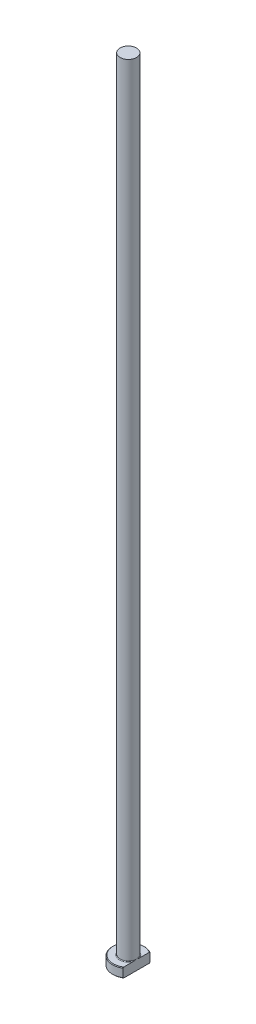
ISO-10303-21;
HEADER;
FILE_DESCRIPTION(('STEP AP214'),'2;1');
FILE_NAME('part.step','',(''),(''),'','','');
FILE_SCHEMA(('AUTOMOTIVE_DESIGN { 1 0 10303 214 1 1 1 1 }'));
ENDSEC;
DATA;
#1=APPLICATION_CONTEXT('core data for automotive mechanical design processes');
#2=APPLICATION_PROTOCOL_DEFINITION('international standard','automotive_design',2000,#1);
#3=PRODUCT_CONTEXT('',#1,'mechanical');
#4=PRODUCT('Part','Part','',(#3));
#5=PRODUCT_RELATED_PRODUCT_CATEGORY('part','',(#4));
#6=PRODUCT_DEFINITION_FORMATION('','',#4);
#7=PRODUCT_DEFINITION_CONTEXT('part definition',#1,'design');
#8=PRODUCT_DEFINITION('design','',#6,#7);
#9=PRODUCT_DEFINITION_SHAPE('','',#8);
#10=(LENGTH_UNIT() NAMED_UNIT(*) SI_UNIT(.MILLI.,.METRE.));
#11=(NAMED_UNIT(*) PLANE_ANGLE_UNIT() SI_UNIT($,.RADIAN.));
#12=(NAMED_UNIT(*) SI_UNIT($,.STERADIAN.) SOLID_ANGLE_UNIT());
#13=UNCERTAINTY_MEASURE_WITH_UNIT(LENGTH_MEASURE(1.E-05),#10,'distance_accuracy_value','');
#14=(GEOMETRIC_REPRESENTATION_CONTEXT(3) GLOBAL_UNCERTAINTY_ASSIGNED_CONTEXT((#13)) GLOBAL_UNIT_ASSIGNED_CONTEXT((#10,
#11,#12)) REPRESENTATION_CONTEXT('',''));
#15=CARTESIAN_POINT('',(0.,0.,0.));
#16=DIRECTION('',(0.,0.,1.));
#17=DIRECTION('',(1.,0.,0.));
#18=AXIS2_PLACEMENT_3D('',#15,#16,#17);
#19=CARTESIAN_POINT('',(0.,0.,0.));
#20=DIRECTION('',(0.,-1.,0.));
#21=DIRECTION('',(0.,0.,-1.));
#22=AXIS2_PLACEMENT_3D('',#19,#20,#21);
#23=PLANE('',#22);
#24=CARTESIAN_POINT('',(0.,0.,0.));
#25=DIRECTION('',(0.,-1.,0.));
#26=DIRECTION('',(0.,0.,-1.));
#27=AXIS2_PLACEMENT_3D('',#24,#25,#26);
#28=CIRCLE('',#27,4.79999999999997);
#29=CARTESIAN_POINT('',(2.59999999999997,0.,4.03484820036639));
#30=VERTEX_POINT('',#29);
#31=CARTESIAN_POINT('',(2.59999999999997,0.,-4.03484820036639));
#32=VERTEX_POINT('',#31);
#33=EDGE_CURVE('E98',#30,#32,#28,.T.);
#34=ORIENTED_EDGE('',*,*,#33,.T.);
#35=DIRECTION('',(0.,0.,1.));
#36=VECTOR('',#35,1.);
#37=CARTESIAN_POINT('',(2.59999999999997,0.,-4.27083130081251));
#38=LINE('',#37,#36);
#39=EDGE_CURVE('E83',#32,#30,#38,.T.);
#40=ORIENTED_EDGE('',*,*,#39,.T.);
#41=EDGE_LOOP('',(#34,#40));
#42=FACE_BOUND('',#41,.T.);
#43=ADVANCED_FACE('F32',(#42),#23,.T.);
#44=CARTESIAN_POINT('',(0.,259.958771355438,0.));
#45=DIRECTION('',(0.,1.,0.));
#46=DIRECTION('',(0.,0.,1.));
#47=AXIS2_PLACEMENT_3D('',#44,#45,#46);
#48=CYLINDRICAL_SURFACE('',#47,4.99999999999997);
#49=CARTESIAN_POINT('',(0.,2.79999999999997,0.));
#50=DIRECTION('',(0.,1.,0.));
#51=DIRECTION('',(0.,0.,1.));
#52=AXIS2_PLACEMENT_3D('',#49,#50,#51);
#53=CIRCLE('',#52,4.99999999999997);
#54=CARTESIAN_POINT('',(2.59999999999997,2.79999999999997,4.27083130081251));
#55=VERTEX_POINT('',#54);
#56=CARTESIAN_POINT('',(2.59999999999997,2.79999999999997,-4.27083130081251));
#57=VERTEX_POINT('',#56);
#58=EDGE_CURVE('E104',#55,#57,#53,.F.);
#59=ORIENTED_EDGE('',*,*,#58,.T.);
#60=DIRECTION('',(0.,-1.,0.));
#61=VECTOR('',#60,1.);
#62=CARTESIAN_POINT('',(2.59999999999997,250.,-4.27083130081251));
#63=LINE('',#62,#61);
#64=CARTESIAN_POINT('',(2.59999999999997,0.200000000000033,-4.27083130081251));
#65=VERTEX_POINT('',#64);
#66=EDGE_CURVE('E183',#57,#65,#63,.T.);
#67=ORIENTED_EDGE('',*,*,#66,.T.);
#68=CARTESIAN_POINT('',(0.,0.200000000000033,0.));
#69=DIRECTION('',(0.,-1.,0.));
#70=DIRECTION('',(0.,0.,-1.));
#71=AXIS2_PLACEMENT_3D('',#68,#69,#70);
#72=CIRCLE('',#71,4.99999999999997);
#73=CARTESIAN_POINT('',(2.59999999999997,0.200000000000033,4.27083130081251));
#74=VERTEX_POINT('',#73);
#75=EDGE_CURVE('E100',#65,#74,#72,.F.);
#76=ORIENTED_EDGE('',*,*,#75,.T.);
#77=DIRECTION('',(0.,-1.,0.));
#78=VECTOR('',#77,1.);
#79=CARTESIAN_POINT('',(2.59999999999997,250.,4.27083130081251));
#80=LINE('',#79,#78);
#81=EDGE_CURVE('E93',#55,#74,#80,.T.);
#82=ORIENTED_EDGE('',*,*,#81,.F.);
#83=EDGE_LOOP('',(#59,#67,#76,#82));
#84=FACE_BOUND('',#83,.T.);
#85=ADVANCED_FACE('F158',(#84),#48,.T.);
#86=CARTESIAN_POINT('',(-4.99999999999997,3.,0.));
#87=DIRECTION('',(0.,1.,0.));
#88=DIRECTION('',(0.,0.,1.));
#89=AXIS2_PLACEMENT_3D('',#86,#87,#88);
#90=PLANE('',#89);
#91=CARTESIAN_POINT('',(0.,3.,0.));
#92=DIRECTION('',(0.,1.,0.));
#93=DIRECTION('',(0.,0.,1.));
#94=AXIS2_PLACEMENT_3D('',#91,#92,#93);
#95=CIRCLE('',#94,4.79999999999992);
#96=CARTESIAN_POINT('',(2.59999999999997,3.,-4.03484820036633));
#97=VERTEX_POINT('',#96);
#98=CARTESIAN_POINT('',(2.59999999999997,3.,4.03484820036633));
#99=VERTEX_POINT('',#98);
#100=EDGE_CURVE('E178',#97,#99,#95,.T.);
#101=ORIENTED_EDGE('',*,*,#100,.T.);
#102=DIRECTION('',(0.,0.,-1.));
#103=VECTOR('',#102,1.);
#104=CARTESIAN_POINT('',(2.59999999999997,3.,0.));
#105=LINE('',#104,#103);
#106=CARTESIAN_POINT('',(2.59999999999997,2.99999999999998,1.03923048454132));
#107=VERTEX_POINT('',#106);
#108=EDGE_CURVE('E57',#99,#107,#105,.T.);
#109=ORIENTED_EDGE('',*,*,#108,.T.);
#110=CARTESIAN_POINT('',(0.,3.,0.));
#111=DIRECTION('',(0.,1.,0.));
#112=DIRECTION('',(0.,0.,1.));
#113=AXIS2_PLACEMENT_3D('',#110,#111,#112);
#114=CIRCLE('',#113,2.79999999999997);
#115=CARTESIAN_POINT('',(2.59999999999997,2.99999999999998,-1.03923048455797));
#116=VERTEX_POINT('',#115);
#117=EDGE_CURVE('E107',#107,#116,#114,.F.);
#118=ORIENTED_EDGE('',*,*,#117,.T.);
#119=EDGE_CURVE('E136',#116,#97,#105,.T.);
#120=ORIENTED_EDGE('',*,*,#119,.T.);
#121=EDGE_LOOP('',(#101,#109,#118,#120));
#122=FACE_BOUND('',#121,.T.);
#123=ADVANCED_FACE('F147',(#122),#90,.T.);
#124=CARTESIAN_POINT('',(0.,3.,0.));
#125=DIRECTION('',(0.,-1.,0.));
#126=DIRECTION('',(0.,0.,-1.));
#127=AXIS2_PLACEMENT_3D('',#124,#125,#126);
#128=CONICAL_SURFACE('',#127,4.79999999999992,0.785398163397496);
#129=ORIENTED_EDGE('',*,*,#58,.F.);
#130=CARTESIAN_POINT('',(2.59999999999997,-1.95047472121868,9.397433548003));
#131=CARTESIAN_POINT('',(2.59999999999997,-1.76015203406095,9.19995130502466));
#132=CARTESIAN_POINT('',(2.59999999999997,-1.57004107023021,9.0022644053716));
#133=CARTESIAN_POINT('',(2.59999999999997,-1.19035454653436,8.60637345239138));
#134=CARTESIAN_POINT('',(2.59999999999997,-1.00077899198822,8.40816939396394));
#135=CARTESIAN_POINT('',(2.59999999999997,-0.622208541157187,8.01106626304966));
#136=CARTESIAN_POINT('',(2.59999999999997,-0.43321388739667,7.81216695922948));
#137=CARTESIAN_POINT('',(2.59999999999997,-0.0560371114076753,7.41360059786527));
#138=CARTESIAN_POINT('',(2.59999999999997,0.132145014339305,7.21393354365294));
#139=CARTESIAN_POINT('',(2.59999999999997,0.504316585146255,6.81701377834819));
#140=CARTESIAN_POINT('',(2.59999999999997,0.688323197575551,6.61977717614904));
#141=CARTESIAN_POINT('',(2.59999999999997,1.05506202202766,6.22412305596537));
#142=CARTESIAN_POINT('',(2.59999999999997,1.23779424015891,6.02570554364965));
#143=CARTESIAN_POINT('',(2.59999999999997,1.60155525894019,5.62737135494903));
#144=CARTESIAN_POINT('',(2.59999999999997,1.78258432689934,5.42745492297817));
#145=CARTESIAN_POINT('',(2.59999999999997,2.14238277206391,5.02560172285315));
#146=CARTESIAN_POINT('',(2.59999999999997,2.32115220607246,4.82366500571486));
#147=CARTESIAN_POINT('',(2.59999999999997,2.62527031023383,4.4746966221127));
#148=CARTESIAN_POINT('',(2.59999999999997,2.75138938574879,4.32833728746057));
#149=CARTESIAN_POINT('',(2.59999999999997,3.00151582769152,4.03379615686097));
#150=CARTESIAN_POINT('',(2.59999999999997,3.12552298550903,3.88561418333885));
#151=CARTESIAN_POINT('',(2.59999999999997,3.37190002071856,3.58545728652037));
#152=CARTESIAN_POINT('',(2.59999999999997,3.49424212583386,3.43345946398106));
#153=CARTESIAN_POINT('',(2.59999999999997,3.73490070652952,3.12636139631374));
#154=CARTESIAN_POINT('',(2.59999999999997,3.85321820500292,2.97126195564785));
#155=CARTESIAN_POINT('',(2.59999999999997,4.08579009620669,2.65464223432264));
#156=CARTESIAN_POINT('',(2.59999999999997,4.19996477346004,2.49306256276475));
#157=CARTESIAN_POINT('',(2.59999999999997,4.36468341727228,2.24613590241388));
#158=CARTESIAN_POINT('',(2.59999999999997,4.41853818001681,2.16300143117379));
#159=CARTESIAN_POINT('',(2.59999999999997,4.52346182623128,1.99499855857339));
#160=CARTESIAN_POINT('',(2.59999999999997,4.57453099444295,1.9101303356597));
#161=CARTESIAN_POINT('',(2.59999999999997,4.67263274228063,1.7393256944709));
#162=CARTESIAN_POINT('',(2.59999999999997,4.7197040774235,1.65341183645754));
#163=CARTESIAN_POINT('',(2.59999999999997,4.80952240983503,1.47936505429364));
#164=CARTESIAN_POINT('',(2.59999999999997,4.85226857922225,1.3912317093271));
#165=CARTESIAN_POINT('',(2.59999999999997,4.97211006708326,1.12354274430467));
#166=CARTESIAN_POINT('',(2.59999999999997,5.04118725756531,0.940070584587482));
#167=CARTESIAN_POINT('',(2.59999999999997,5.11752261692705,0.665284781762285));
#168=CARTESIAN_POINT('',(2.59999999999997,5.13802992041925,0.577624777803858));
#169=CARTESIAN_POINT('',(2.59999999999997,5.17073291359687,0.400736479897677));
#170=CARTESIAN_POINT('',(2.59999999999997,5.18292955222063,0.311508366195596));
#171=CARTESIAN_POINT('',(2.59999999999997,5.19813789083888,0.13262811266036));
#172=CARTESIAN_POINT('',(2.59999999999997,5.20118701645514,0.0429792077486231));
#173=CARTESIAN_POINT('',(2.59999999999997,5.19797827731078,-0.13615453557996));
#174=CARTESIAN_POINT('',(2.59999999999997,5.19171987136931,-0.225639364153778));
#175=CARTESIAN_POINT('',(2.59999999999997,5.17043196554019,-0.402893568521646));
#176=CARTESIAN_POINT('',(2.59999999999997,5.15546490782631,-0.49067060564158));
#177=CARTESIAN_POINT('',(2.59999999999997,5.11776551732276,-0.664523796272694));
#178=CARTESIAN_POINT('',(2.59999999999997,5.09503206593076,-0.750599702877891));
#179=CARTESIAN_POINT('',(2.59999999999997,5.04281440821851,-0.921261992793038));
#180=CARTESIAN_POINT('',(2.59999999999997,5.01328729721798,-1.00583506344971));
#181=CARTESIAN_POINT('',(2.59999999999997,4.94875799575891,-1.17281894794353));
#182=CARTESIAN_POINT('',(2.59999999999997,4.91375683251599,-1.25523016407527));
#183=CARTESIAN_POINT('',(2.59999999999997,4.80599778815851,-1.49096020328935));
#184=CARTESIAN_POINT('',(2.59999999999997,4.72750956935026,-1.64165062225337));
#185=CARTESIAN_POINT('',(2.59999999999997,4.55999715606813,-1.93711610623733));
#186=CARTESIAN_POINT('',(2.59999999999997,4.47096030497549,-2.08188377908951));
#187=CARTESIAN_POINT('',(2.59999999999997,4.28541544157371,-2.36729512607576));
#188=CARTESIAN_POINT('',(2.59999999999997,4.18888021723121,-2.50792095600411));
#189=CARTESIAN_POINT('',(2.59999999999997,3.99085344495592,-2.78550445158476));
#190=CARTESIAN_POINT('',(2.59999999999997,3.88936425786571,-2.92246381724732));
#191=CARTESIAN_POINT('',(2.59999999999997,3.68147097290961,-3.19533708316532));
#192=CARTESIAN_POINT('',(2.59999999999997,3.57502092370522,-3.3312158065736));
#193=CARTESIAN_POINT('',(2.59999999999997,3.35937457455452,-3.60078977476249));
#194=CARTESIAN_POINT('',(2.59999999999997,3.25017800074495,-3.7344847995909));
#195=CARTESIAN_POINT('',(2.59999999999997,3.02996614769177,-3.99983567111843));
#196=CARTESIAN_POINT('',(2.59999999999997,2.91895572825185,-4.1314955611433));
#197=CARTESIAN_POINT('',(2.59999999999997,2.69532568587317,-4.39344289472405));
#198=CARTESIAN_POINT('',(2.59999999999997,2.58270603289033,-4.52373031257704));
#199=CARTESIAN_POINT('',(2.59999999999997,2.28823888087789,-4.86104966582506));
#200=CARTESIAN_POINT('',(2.59999999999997,2.10540318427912,-5.06721827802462));
#201=CARTESIAN_POINT('',(2.59999999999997,1.73743041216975,-5.47749422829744));
#202=CARTESIAN_POINT('',(2.59999999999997,1.55229327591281,-5.68160151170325));
#203=CARTESIAN_POINT('',(2.59999999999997,1.18015264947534,-6.08844300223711));
#204=CARTESIAN_POINT('',(2.59999999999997,0.993147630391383,-6.29117580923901));
#205=CARTESIAN_POINT('',(2.59999999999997,0.617846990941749,-6.69544313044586));
#206=CARTESIAN_POINT('',(2.59999999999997,0.429551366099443,-6.89697764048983));
#207=CARTESIAN_POINT('',(2.59999999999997,0.0594707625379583,-7.29110398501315));
#208=CARTESIAN_POINT('',(2.59999999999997,-0.122275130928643,-7.48373254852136));
#209=CARTESIAN_POINT('',(2.59999999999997,-0.486506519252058,-7.86829020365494));
#210=CARTESIAN_POINT('',(2.59999999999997,-0.668992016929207,-8.06021929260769));
#211=CARTESIAN_POINT('',(2.59999999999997,-1.03436396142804,-8.44329936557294));
#212=CARTESIAN_POINT('',(2.59999999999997,-1.21724976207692,-8.63445096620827));
#213=CARTESIAN_POINT('',(2.59999999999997,-1.58351605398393,-9.01627657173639));
#214=CARTESIAN_POINT('',(2.59999999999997,-1.76689654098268,-9.20695058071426));
#215=CARTESIAN_POINT('',(2.59999999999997,-1.95047472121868,-9.397433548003));
#216=B_SPLINE_CURVE_WITH_KNOTS('',3,(#130,#131,#132,#133,#134,#135,#136,#137,#138,#139,#140,
#141,#142,#143,#144,#145,#146,#147,#148,#149,#150,#151,#152,#153,#154,#155,#156,#157,#158,#159,
#160,#161,#162,#163,#164,#165,#166,#167,#168,#169,#170,#171,#172,#173,#174,#175,#176,#177,#178,
#179,#180,#181,#182,#183,#184,#185,#186,#187,#188,#189,#190,#191,#192,#193,#194,#195,#196,#197,
#198,#199,#200,#201,#202,#203,#204,#205,#206,#207,#208,#209,#210,#211,#212,#213,#214,#215),
.UNSPECIFIED.,.F.,.F.,(4,2,2,2,2,2,2,2,2,2,2,2,2,2,2,2,2,2,2,2,2,2,2,2,2,2,2,2,2,2,2,2,2,2,2,2,
2,2,2,2,2,2,4),(0.,0.822799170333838,1.64560648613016,2.46872021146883,3.29183036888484,
4.10105194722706,4.91026964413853,5.71935814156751,6.5284262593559,7.10801764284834,
7.68766594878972,8.27296873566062,8.85812163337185,9.45143823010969,9.74855643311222,
10.0456442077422,10.3394095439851,10.6332310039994,11.2186835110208,11.4884410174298,
11.7581677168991,12.0267893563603,12.2954266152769,12.5621610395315,12.8289338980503,
13.0974401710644,13.3658961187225,13.8748906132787,14.3845021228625,14.896058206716,
15.4073728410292,15.9251595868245,16.4429981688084,16.9596236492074,17.4762587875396,
18.3029176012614,19.1295982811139,19.9570225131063,20.7844496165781,21.5789508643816,
22.3734551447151,23.1671010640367,23.9607401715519),.UNSPECIFIED.);
#217=EDGE_CURVE('E135',#55,#99,#216,.T.);
#218=ORIENTED_EDGE('',*,*,#217,.T.);
#219=ORIENTED_EDGE('',*,*,#100,.F.);
#220=EDGE_CURVE('E127',#97,#57,#216,.T.);
#221=ORIENTED_EDGE('',*,*,#220,.T.);
#222=EDGE_LOOP('',(#129,#218,#219,#221));
#223=FACE_BOUND('',#222,.T.);
#224=ADVANCED_FACE('F143',(#223),#128,.T.);
#225=CARTESIAN_POINT('',(0.,0.200000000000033,0.));
#226=DIRECTION('',(0.,1.,0.));
#227=DIRECTION('',(0.,0.,1.));
#228=AXIS2_PLACEMENT_3D('',#225,#226,#227);
#229=CONICAL_SURFACE('',#228,4.99999999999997,0.785398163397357);
#230=ORIENTED_EDGE('',*,*,#75,.F.);
#231=CARTESIAN_POINT('',(2.59999999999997,4.95047472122,-9.397433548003));
#232=CARTESIAN_POINT('',(2.59999999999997,4.7601520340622,-9.19995130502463));
#233=CARTESIAN_POINT('',(2.59999999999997,4.57004107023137,-9.00226440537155));
#234=CARTESIAN_POINT('',(2.59999999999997,4.19035454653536,-8.60637345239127));
#235=CARTESIAN_POINT('',(2.59999999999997,4.00077899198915,-8.4081693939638));
#236=CARTESIAN_POINT('',(2.59999999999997,3.62220854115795,-8.01106626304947));
#237=CARTESIAN_POINT('',(2.59999999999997,3.43321388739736,-7.81216695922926));
#238=CARTESIAN_POINT('',(2.59999999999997,3.05603711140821,-7.41360059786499));
#239=CARTESIAN_POINT('',(2.59999999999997,2.86785498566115,-7.21393354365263));
#240=CARTESIAN_POINT('',(2.59999999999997,2.49568341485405,-6.81701377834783));
#241=CARTESIAN_POINT('',(2.59999999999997,2.31167680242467,-6.61977717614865));
#242=CARTESIAN_POINT('',(2.59999999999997,1.94493797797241,-6.22412305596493));
#243=CARTESIAN_POINT('',(2.59999999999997,1.7622057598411,-6.02570554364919));
#244=CARTESIAN_POINT('',(2.59999999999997,1.39844474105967,-5.62737135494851));
#245=CARTESIAN_POINT('',(2.59999999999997,1.21741567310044,-5.42745492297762));
#246=CARTESIAN_POINT('',(2.59999999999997,0.85761722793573,-5.02560172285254));
#247=CARTESIAN_POINT('',(2.59999999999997,0.678847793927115,-4.82366500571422));
#248=CARTESIAN_POINT('',(2.59999999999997,0.374729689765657,-4.47469662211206));
#249=CARTESIAN_POINT('',(2.59999999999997,0.248610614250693,-4.32833728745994));
#250=CARTESIAN_POINT('',(2.59999999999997,-0.00151582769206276,-4.03379615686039));
#251=CARTESIAN_POINT('',(2.59999999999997,-0.125522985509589,-3.88561418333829));
#252=CARTESIAN_POINT('',(2.59999999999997,-0.371900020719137,-3.58545728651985));
#253=CARTESIAN_POINT('',(2.59999999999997,-0.494242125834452,-3.43345946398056));
#254=CARTESIAN_POINT('',(2.59999999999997,-0.734900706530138,-3.12636139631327));
#255=CARTESIAN_POINT('',(2.59999999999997,-0.853218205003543,-2.9712619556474));
#256=CARTESIAN_POINT('',(2.59999999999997,-1.08579009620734,-2.65464223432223));
#257=CARTESIAN_POINT('',(2.59999999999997,-1.1999647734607,-2.49306256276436));
#258=CARTESIAN_POINT('',(2.59999999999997,-1.36468341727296,-2.2461359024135));
#259=CARTESIAN_POINT('',(2.59999999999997,-1.41853818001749,-2.16300143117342));
#260=CARTESIAN_POINT('',(2.59999999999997,-1.52346182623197,-1.99499855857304));
#261=CARTESIAN_POINT('',(2.59999999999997,-1.57453099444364,-1.91013033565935));
#262=CARTESIAN_POINT('',(2.59999999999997,-1.67263274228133,-1.73932569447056));
#263=CARTESIAN_POINT('',(2.59999999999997,-1.71970407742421,-1.65341183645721));
#264=CARTESIAN_POINT('',(2.59999999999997,-1.80952240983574,-1.47936505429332));
#265=CARTESIAN_POINT('',(2.59999999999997,-1.85226857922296,-1.39123170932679));
#266=CARTESIAN_POINT('',(2.59999999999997,-1.97211006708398,-1.12354274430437));
#267=CARTESIAN_POINT('',(2.59999999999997,-2.04118725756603,-0.94007058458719));
#268=CARTESIAN_POINT('',(2.59999999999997,-2.11752261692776,-0.66528478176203));
#269=CARTESIAN_POINT('',(2.59999999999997,-2.13802992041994,-0.577624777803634));
#270=CARTESIAN_POINT('',(2.59999999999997,-2.17073291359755,-0.400736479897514));
#271=CARTESIAN_POINT('',(2.59999999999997,-2.1829295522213,-0.311508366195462));
#272=CARTESIAN_POINT('',(2.59999999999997,-2.19813789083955,-0.132628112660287));
#273=CARTESIAN_POINT('',(2.59999999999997,-2.2011870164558,-0.0429792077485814));
#274=CARTESIAN_POINT('',(2.59999999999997,-2.19797827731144,0.13615453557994));
#275=CARTESIAN_POINT('',(2.59999999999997,-2.19171987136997,0.225639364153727));
#276=CARTESIAN_POINT('',(2.59999999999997,-2.17043196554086,0.402893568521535));
#277=CARTESIAN_POINT('',(2.59999999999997,-2.15546490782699,0.490670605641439));
#278=CARTESIAN_POINT('',(2.59999999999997,-2.11776551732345,0.664523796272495));
#279=CARTESIAN_POINT('',(2.59999999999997,-2.09503206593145,0.750599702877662));
#280=CARTESIAN_POINT('',(2.59999999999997,-2.04281440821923,0.92126199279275));
#281=CARTESIAN_POINT('',(2.59999999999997,-2.0132872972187,1.00583506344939));
#282=CARTESIAN_POINT('',(2.59999999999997,-1.94875799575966,1.17281894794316));
#283=CARTESIAN_POINT('',(2.59999999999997,-1.91375683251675,1.25523016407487));
#284=CARTESIAN_POINT('',(2.59999999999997,-1.80599778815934,1.49096020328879));
#285=CARTESIAN_POINT('',(2.59999999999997,-1.72750956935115,1.6416506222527));
#286=CARTESIAN_POINT('',(2.59999999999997,-1.55999715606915,1.93711610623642));
#287=CARTESIAN_POINT('',(2.59999999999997,-1.47096030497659,2.08188377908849));
#288=CARTESIAN_POINT('',(2.59999999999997,-1.28541544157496,2.36729512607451));
#289=CARTESIAN_POINT('',(2.59999999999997,-1.18888021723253,2.50792095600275));
#290=CARTESIAN_POINT('',(2.59999999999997,-0.990853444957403,2.78550445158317));
#291=CARTESIAN_POINT('',(2.59999999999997,-0.889364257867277,2.92246381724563));
#292=CARTESIAN_POINT('',(2.59999999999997,-0.681470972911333,3.19533708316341));
#293=CARTESIAN_POINT('',(2.59999999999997,-0.575020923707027,3.33121580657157));
#294=CARTESIAN_POINT('',(2.59999999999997,-0.359374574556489,3.60078977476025));
#295=CARTESIAN_POINT('',(2.59999999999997,-0.250178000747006,3.73448479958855));
#296=CARTESIAN_POINT('',(2.59999999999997,-0.0299661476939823,3.99983567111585));
#297=CARTESIAN_POINT('',(2.59999999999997,0.0810442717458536,4.13149556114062));
#298=CARTESIAN_POINT('',(2.59999999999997,0.304674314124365,4.39344289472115));
#299=CARTESIAN_POINT('',(2.59999999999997,0.417293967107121,4.52373031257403));
#300=CARTESIAN_POINT('',(2.59999999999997,0.711761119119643,4.8610496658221));
#301=CARTESIAN_POINT('',(2.59999999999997,0.894596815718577,5.06721827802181));
#302=CARTESIAN_POINT('',(2.59999999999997,1.26256958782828,5.47749422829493));
#303=CARTESIAN_POINT('',(2.59999999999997,1.44770672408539,5.68160151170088));
#304=CARTESIAN_POINT('',(2.59999999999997,1.8198473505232,6.08844300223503));
#305=CARTESIAN_POINT('',(2.59999999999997,2.00685236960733,6.29117580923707));
#306=CARTESIAN_POINT('',(2.59999999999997,2.38215300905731,6.6954431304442));
#307=CARTESIAN_POINT('',(2.59999999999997,2.5704486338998,6.89697764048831));
#308=CARTESIAN_POINT('',(2.59999999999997,2.94052923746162,7.29110398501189));
#309=CARTESIAN_POINT('',(2.59999999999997,3.12227513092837,7.48373254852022));
#310=CARTESIAN_POINT('',(2.59999999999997,3.48650651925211,7.86829020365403));
#311=CARTESIAN_POINT('',(2.59999999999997,3.66899201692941,8.06021929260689));
#312=CARTESIAN_POINT('',(2.59999999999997,4.03436396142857,8.44329936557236));
#313=CARTESIAN_POINT('',(2.59999999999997,4.21724976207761,8.63445096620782));
#314=CARTESIAN_POINT('',(2.59999999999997,4.58351605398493,9.01627657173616));
#315=CARTESIAN_POINT('',(2.59999999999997,4.76689654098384,9.20695058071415));
#316=CARTESIAN_POINT('',(2.59999999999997,4.95047472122,9.397433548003));
#317=B_SPLINE_CURVE_WITH_KNOTS('',3,(#231,#232,#233,#234,#235,#236,#237,#238,#239,#240,#241,
#242,#243,#244,#245,#246,#247,#248,#249,#250,#251,#252,#253,#254,#255,#256,#257,#258,#259,#260,
#261,#262,#263,#264,#265,#266,#267,#268,#269,#270,#271,#272,#273,#274,#275,#276,#277,#278,#279,
#280,#281,#282,#283,#284,#285,#286,#287,#288,#289,#290,#291,#292,#293,#294,#295,#296,#297,#298,
#299,#300,#301,#302,#303,#304,#305,#306,#307,#308,#309,#310,#311,#312,#313,#314,#315,#316),
.UNSPECIFIED.,.F.,.F.,(4,2,2,2,2,2,2,2,2,2,2,2,2,2,2,2,2,2,2,2,2,2,2,2,2,2,2,2,2,2,2,2,2,2,2,2,
2,2,2,2,2,2,4),(0.,0.822799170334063,1.64560648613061,2.4687202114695,3.29183036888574,
4.10105194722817,4.91026964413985,5.71935814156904,6.52842625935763,7.10801764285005,
7.68766594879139,8.27296873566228,8.85812163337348,9.4514382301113,9.74855643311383,
10.0456442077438,10.3394095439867,10.633231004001,11.2186835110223,11.4884410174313,
11.7581677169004,12.0267893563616,12.2954266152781,12.5621610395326,12.8289338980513,
13.0974401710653,13.3658961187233,13.8748906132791,14.3845021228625,14.8960582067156,
15.4073728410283,15.9251595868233,16.4429981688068,16.9596236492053,17.4762587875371,
18.3029176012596,19.1295982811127,19.9570225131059,20.7844496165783,21.5789508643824,
22.3734551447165,23.1671010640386,23.9607401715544),.UNSPECIFIED.);
#318=EDGE_CURVE('E86',#65,#32,#317,.T.);
#319=ORIENTED_EDGE('',*,*,#318,.T.);
#320=ORIENTED_EDGE('',*,*,#33,.F.);
#321=EDGE_CURVE('E89',#30,#74,#317,.T.);
#322=ORIENTED_EDGE('',*,*,#321,.T.);
#323=EDGE_LOOP('',(#230,#319,#320,#322));
#324=FACE_BOUND('',#323,.T.);
#325=ADVANCED_FACE('F97',(#324),#229,.T.);
#326=CARTESIAN_POINT('',(0.,3.19999999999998,0.));
#327=DIRECTION('',(0.,1.,0.));
#328=DIRECTION('',(0.,0.,1.));
#329=AXIS2_PLACEMENT_3D('',#326,#327,#328);
#330=TOROIDAL_SURFACE('',#329,2.79999999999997,0.2);
#331=CARTESIAN_POINT('',(2.59999999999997,3.19999999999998,0.));
#332=CARTESIAN_POINT('',(2.59999999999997,3.20000050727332,1.23579409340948E-10));
#333=CARTESIAN_POINT('',(2.59999999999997,3.20000101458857,-1.74789552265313E-07));
#334=CARTESIAN_POINT('',(2.59999999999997,3.20000196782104,-6.73287793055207E-07));
#335=CARTESIAN_POINT('',(2.59999999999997,3.20000240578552,-1.00747163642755E-06));
#336=CARTESIAN_POINT('',(2.59999999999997,3.20000330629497,-1.80604944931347E-06));
#337=CARTESIAN_POINT('',(2.59999999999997,3.20000375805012,-2.28310921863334E-06));
#338=CARTESIAN_POINT('',(2.59999999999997,3.20000457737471,-3.28018171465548E-06));
#339=CARTESIAN_POINT('',(2.59999999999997,3.20000494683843,-3.79874305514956E-06));
#340=CARTESIAN_POINT('',(2.59999999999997,3.20000629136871,-5.77594334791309E-06));
#341=CARTESIAN_POINT('',(2.59999999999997,3.20000719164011,-7.28765589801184E-06));
#342=CARTESIAN_POINT('',(2.59999999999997,3.20000869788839,-1.03067582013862E-05));
#343=CARTESIAN_POINT('',(2.59999999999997,3.20000932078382,-1.18060929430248E-05));
#344=CARTESIAN_POINT('',(2.59999999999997,3.20001188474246,-1.80612988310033E-05));
#345=CARTESIAN_POINT('',(2.59999999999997,3.20001376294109,-2.28467812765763E-05));
#346=CARTESIAN_POINT('',(2.59999999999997,3.20001657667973,-3.19530305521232E-05));
#347=CARTESIAN_POINT('',(2.59999999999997,3.20001760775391,-3.62442681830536E-05));
#348=CARTESIAN_POINT('',(2.59999999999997,3.20002504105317,-6.7868346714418E-05));
#349=CARTESIAN_POINT('',(2.59999999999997,3.20003059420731,-9.53536176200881E-05));
#350=CARTESIAN_POINT('',(2.59999999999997,3.20005490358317,-0.000203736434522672));
#351=CARTESIAN_POINT('',(2.59999999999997,3.20007818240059,-0.000283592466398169));
#352=CARTESIAN_POINT('',(2.59999999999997,3.2001686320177,-0.000599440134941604));
#353=CARTESIAN_POINT('',(2.59999999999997,3.2002328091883,-0.000836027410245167));
#354=CARTESIAN_POINT('',(2.59999999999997,3.20048945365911,-0.00177477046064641));
#355=CARTESIAN_POINT('',(2.59999999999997,3.20068565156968,-0.00247616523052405));
#356=CARTESIAN_POINT('',(2.59999999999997,3.20149940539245,-0.0053934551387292));
#357=CARTESIAN_POINT('',(2.59999999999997,3.20211229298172,-0.007610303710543));
#358=CARTESIAN_POINT('',(2.59999999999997,3.2076646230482,-0.0276831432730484));
#359=CARTESIAN_POINT('',(2.59999999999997,3.21262302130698,-0.0455354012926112));
#360=CARTESIAN_POINT('',(2.59999999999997,3.22230897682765,-0.0805439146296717));
#361=CARTESIAN_POINT('',(2.59999999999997,3.22703791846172,-0.0976998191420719));
#362=CARTESIAN_POINT('',(2.59999999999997,3.23705035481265,-0.134181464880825));
#363=CARTESIAN_POINT('',(2.59999999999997,3.2423287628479,-0.153508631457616));
#364=CARTESIAN_POINT('',(2.59999999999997,3.25286316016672,-0.192393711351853));
#365=CARTESIAN_POINT('',(2.59999999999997,3.25811828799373,-0.211951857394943));
#366=CARTESIAN_POINT('',(2.59999999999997,3.27070509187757,-0.259316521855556));
#367=CARTESIAN_POINT('',(2.59999999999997,3.27798202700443,-0.287137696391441));
#368=CARTESIAN_POINT('',(2.59999999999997,3.29204094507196,-0.342105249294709));
#369=CARTESIAN_POINT('',(2.59999999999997,3.29883098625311,-0.36924957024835));
#370=CARTESIAN_POINT('',(2.59999999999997,3.32069835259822,-0.459246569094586));
#371=CARTESIAN_POINT('',(2.59999999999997,3.33498012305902,-0.522296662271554));
#372=CARTESIAN_POINT('',(2.59999999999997,3.36056532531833,-0.649787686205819));
#373=CARTESIAN_POINT('',(2.59999999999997,3.37183254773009,-0.714236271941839));
#374=CARTESIAN_POINT('',(2.59999999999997,3.38542084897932,-0.81395858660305));
#375=CARTESIAN_POINT('',(2.59999999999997,3.38947199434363,-0.84899397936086));
#376=CARTESIAN_POINT('',(2.59999999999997,3.39578733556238,-0.91922149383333));
#377=CARTESIAN_POINT('',(2.59999999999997,3.39805216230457,-0.954413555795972));
#378=CARTESIAN_POINT('',(2.59999999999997,3.40031330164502,-1.02465521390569));
#379=CARTESIAN_POINT('',(2.59999999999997,3.40032384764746,-1.05970430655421));
#380=CARTESIAN_POINT('',(2.59999999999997,3.39745377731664,-1.1296713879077));
#381=CARTESIAN_POINT('',(2.59999999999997,3.39457726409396,-1.16458949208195));
#382=CARTESIAN_POINT('',(2.59999999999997,3.38762659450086,-1.21434358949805));
#383=CARTESIAN_POINT('',(2.59999999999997,3.3851418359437,-1.22940327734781));
#384=CARTESIAN_POINT('',(2.59999999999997,3.37928992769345,-1.25936829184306));
#385=CARTESIAN_POINT('',(2.59999999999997,3.37592199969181,-1.27427347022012));
#386=CARTESIAN_POINT('',(2.59999999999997,3.36819593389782,-1.30360801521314));
#387=CARTESIAN_POINT('',(2.59999999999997,3.36385215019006,-1.31804111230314));
#388=CARTESIAN_POINT('',(2.59999999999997,3.35394180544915,-1.34647366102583));
#389=CARTESIAN_POINT('',(2.59999999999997,3.34837682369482,-1.36047364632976));
#390=CARTESIAN_POINT('',(2.59999999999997,3.3378467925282,-1.3832098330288));
#391=CARTESIAN_POINT('',(2.59999999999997,3.33330355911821,-1.39214053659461));
#392=CARTESIAN_POINT('',(2.59999999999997,3.32341812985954,-1.40958482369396));
#393=CARTESIAN_POINT('',(2.59999999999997,3.31807401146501,-1.41809733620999));
#394=CARTESIAN_POINT('',(2.59999999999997,3.3064185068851,-1.43453575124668));
#395=CARTESIAN_POINT('',(2.59999999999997,3.30010038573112,-1.44245695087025));
#396=CARTESIAN_POINT('',(2.59999999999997,3.28637957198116,-1.45729976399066));
#397=CARTESIAN_POINT('',(2.59999999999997,3.27897945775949,-1.46422367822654));
#398=CARTESIAN_POINT('',(2.59999999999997,3.26567821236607,-1.47448129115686));
#399=CARTESIAN_POINT('',(2.59999999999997,3.26010727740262,-1.47824010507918));
#400=CARTESIAN_POINT('',(2.59999999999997,3.24845655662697,-1.48487520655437));
#401=CARTESIAN_POINT('',(2.59999999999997,3.24237710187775,-1.4877520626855));
#402=CARTESIAN_POINT('',(2.59999999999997,3.22972757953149,-1.49241784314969));
#403=CARTESIAN_POINT('',(2.59999999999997,3.22315282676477,-1.49419437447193));
#404=CARTESIAN_POINT('',(2.59999999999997,3.20978231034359,-1.49640812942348));
#405=CARTESIAN_POINT('',(2.59999999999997,3.20298682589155,-1.49684698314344));
#406=CARTESIAN_POINT('',(2.59999999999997,3.19037691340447,-1.49637060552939));
#407=CARTESIAN_POINT('',(2.59999999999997,3.18455503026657,-1.49563180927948));
#408=CARTESIAN_POINT('',(2.59999999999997,3.17311801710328,-1.49319000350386));
#409=CARTESIAN_POINT('',(2.59999999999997,3.1675030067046,-1.49148644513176));
#410=CARTESIAN_POINT('',(2.59999999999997,3.15514195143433,-1.48668054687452));
#411=CARTESIAN_POINT('',(2.59999999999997,3.14849468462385,-1.48332605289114));
#412=CARTESIAN_POINT('',(2.59999999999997,3.13582833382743,-1.47559145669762));
#413=CARTESIAN_POINT('',(2.59999999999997,3.12981053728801,-1.47120930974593));
#414=CARTESIAN_POINT('',(2.59999999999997,3.11535552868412,-1.45914343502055));
#415=CARTESIAN_POINT('',(2.59999999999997,3.10734855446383,-1.45094839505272));
#416=CARTESIAN_POINT('',(2.59999999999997,3.09265977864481,-1.43346680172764));
#417=CARTESIAN_POINT('',(2.59999999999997,3.08598026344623,-1.4241784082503));
#418=CARTESIAN_POINT('',(2.59999999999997,3.06857102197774,-1.39681642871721));
#419=CARTESIAN_POINT('',(2.59999999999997,3.05915220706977,-1.37791719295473));
#420=CARTESIAN_POINT('',(2.59999999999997,3.04297062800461,-1.3389290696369));
#421=CARTESIAN_POINT('',(2.59999999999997,3.03622846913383,-1.31883227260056));
#422=CARTESIAN_POINT('',(2.59999999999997,3.02432998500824,-1.27632728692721));
#423=CARTESIAN_POINT('',(2.59999999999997,3.01935848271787,-1.25386836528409));
#424=CARTESIAN_POINT('',(2.59999999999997,3.01130018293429,-1.20858750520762));
#425=CARTESIAN_POINT('',(2.59999999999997,3.00821705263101,-1.18576494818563));
#426=CARTESIAN_POINT('',(2.59999999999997,3.00363796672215,-1.1405967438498));
#427=CARTESIAN_POINT('',(2.59999999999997,3.00210096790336,-1.11825509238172));
#428=CARTESIAN_POINT('',(2.59999999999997,3.00022491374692,-1.07361049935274));
#429=CARTESIAN_POINT('',(2.59999999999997,2.99988136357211,-1.05130772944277));
#430=CARTESIAN_POINT('',(2.59999999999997,3.00029323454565,-0.991792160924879));
#431=CARTESIAN_POINT('',(2.59999999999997,3.00193756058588,-0.954585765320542));
#432=CARTESIAN_POINT('',(2.59999999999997,3.00736147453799,-0.880345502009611));
#433=CARTESIAN_POINT('',(2.59999999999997,3.01114096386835,-0.843311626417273));
#434=CARTESIAN_POINT('',(2.59999999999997,3.02049059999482,-0.768589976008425));
#435=CARTESIAN_POINT('',(2.59999999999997,3.02610078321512,-0.730907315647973));
#436=CARTESIAN_POINT('',(2.59999999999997,3.0387231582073,-0.655686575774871));
#437=CARTESIAN_POINT('',(2.59999999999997,3.0457387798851,-0.618149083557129));
#438=CARTESIAN_POINT('',(2.59999999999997,3.06358120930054,-0.52980872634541));
#439=CARTESIAN_POINT('',(2.59999999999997,3.07487037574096,-0.479100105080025));
#440=CARTESIAN_POINT('',(2.59999999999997,3.09870164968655,-0.378576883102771));
#441=CARTESIAN_POINT('',(2.59999999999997,3.1112285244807,-0.328758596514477));
#442=CARTESIAN_POINT('',(2.59999999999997,3.13564556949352,-0.234990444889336));
#443=CARTESIAN_POINT('',(2.59999999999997,3.14744634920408,-0.191016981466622));
#444=CARTESIAN_POINT('',(2.59999999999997,3.17192746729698,-0.101304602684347));
#445=CARTESIAN_POINT('',(2.59999999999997,3.18462387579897,-0.0555700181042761));
#446=CARTESIAN_POINT('',(2.59999999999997,3.19788889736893,-0.00760560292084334));
#447=CARTESIAN_POINT('',(2.59999999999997,3.19850316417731,-0.00538409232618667));
#448=CARTESIAN_POINT('',(2.59999999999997,3.19931724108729,-0.00246573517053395));
#449=CARTESIAN_POINT('',(2.59999999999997,3.19951242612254,-0.00176794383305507));
#450=CARTESIAN_POINT('',(2.59999999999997,3.19976783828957,-0.000833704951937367));
#451=CARTESIAN_POINT('',(2.59999999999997,3.19983177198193,-0.000598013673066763));
#452=CARTESIAN_POINT('',(2.59999999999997,3.19992192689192,-0.000283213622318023));
#453=CARTESIAN_POINT('',(2.59999999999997,3.19994516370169,-0.00020351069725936));
#454=CARTESIAN_POINT('',(2.59999999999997,3.19996943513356,-9.53048357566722E-05));
#455=CARTESIAN_POINT('',(2.59999999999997,3.19997498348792,-6.78414250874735E-05));
#456=CARTESIAN_POINT('',(2.59999999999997,3.1999824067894,-3.62395621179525E-05));
#457=CARTESIAN_POINT('',(2.59999999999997,3.19998343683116,-3.19495761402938E-05));
#458=CARTESIAN_POINT('',(2.59999999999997,3.19998624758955,-2.2845859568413E-05));
#459=CARTESIAN_POINT('',(2.59999999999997,3.19998812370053,-1.80615919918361E-05));
#460=CARTESIAN_POINT('',(2.59999999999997,3.19999068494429,-1.18076342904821E-05));
#461=CARTESIAN_POINT('',(2.59999999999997,3.19999130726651,-1.03083932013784E-05));
#462=CARTESIAN_POINT('',(2.59999999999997,3.19999281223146,-7.28938063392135E-06));
#463=CARTESIAN_POINT('',(2.59999999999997,3.19999371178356,-5.77765312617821E-06));
#464=CARTESIAN_POINT('',(2.59999999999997,3.19999505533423,-3.80031827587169E-06));
#465=CARTESIAN_POINT('',(2.59999999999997,3.19999542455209,-3.28169096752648E-06));
#466=CARTESIAN_POINT('',(2.59999999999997,3.19999624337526,-2.28444217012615E-06));
#467=CARTESIAN_POINT('',(2.59999999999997,3.19999669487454,-1.80727069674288E-06));
#468=CARTESIAN_POINT('',(2.59999999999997,3.19999759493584,-1.00842880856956E-06));
#469=CARTESIAN_POINT('',(2.59999999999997,3.19999803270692,-6.74101888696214E-07));
#470=CARTESIAN_POINT('',(2.59999999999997,3.19999898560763,-1.75245051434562E-07));
#471=CARTESIAN_POINT('',(2.59999999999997,3.19999949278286,-1.23565714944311E-10));
#472=CARTESIAN_POINT('',(2.59999999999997,3.19999999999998,0.));
#473=B_SPLINE_CURVE_WITH_KNOTS('',3,(#331,#332,#333,#334,#335,#336,#337,#338,#339,#340,#341,
#342,#343,#344,#345,#346,#347,#348,#349,#350,#351,#352,#353,#354,#355,#356,#357,#358,#359,#360,
#361,#362,#363,#364,#365,#366,#367,#368,#369,#370,#371,#372,#373,#374,#375,#376,#377,#378,#379,
#380,#381,#382,#383,#384,#385,#386,#387,#388,#389,#390,#391,#392,#393,#394,#395,#396,#397,#398,
#399,#400,#401,#402,#403,#404,#405,#406,#407,#408,#409,#410,#411,#412,#413,#414,#415,#416,#417,
#418,#419,#420,#421,#422,#423,#424,#425,#426,#427,#428,#429,#430,#431,#432,#433,#434,#435,#436,
#437,#438,#439,#440,#441,#442,#443,#444,#445,#446,#447,#448,#449,#450,#451,#452,#453,#454,#455,
#456,#457,#458,#459,#460,#461,#462,#463,#464,#465,#466,#467,#468,#469,#470,#471,#472),
.UNSPECIFIED.,.T.,.F.,(4,2,2,2,2,2,2,2,2,2,2,2,2,2,2,2,2,2,2,2,2,2,2,2,2,2,2,2,2,2,2,2,2,2,2,2,
2,2,2,2,2,2,2,2,2,2,2,2,2,2,2,2,2,2,2,2,2,2,2,2,2,2,2,2,2,2,2,2,2,2,4),(0.,1.53042757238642E-06,
3.18106748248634E-06,5.14121990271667E-06,7.05005828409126E-06,1.23079983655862E-05,
1.7174539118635E-05,3.25667081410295E-05,4.57900795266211E-05,0.00012992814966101,
0.00037919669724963,0.00111488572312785,0.00329950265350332,0.0101999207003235,
0.0657821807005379,0.119169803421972,0.179274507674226,0.24002995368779,0.326299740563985,
0.410240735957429,0.6041400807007,0.800273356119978,0.906045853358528,1.01178097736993,
1.1168484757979,1.22176686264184,1.26753679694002,1.31334720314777,1.35852340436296,
1.40364152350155,1.43367014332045,1.46377203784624,1.49409227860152,1.52434140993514,
1.54444068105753,1.56452696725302,1.58483555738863,1.6051193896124,1.62263810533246,
1.64016679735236,1.66238011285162,1.6846380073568,1.71881594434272,1.75305224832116,
1.81604715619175,1.87951801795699,1.94841441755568,2.01744419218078,2.08458891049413,
2.15148046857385,2.26311962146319,2.37475362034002,2.48901400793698,2.60355671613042,
2.75937570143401,2.91347192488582,3.0500585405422,3.19244561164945,3.19936059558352,
3.20153398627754,3.20226688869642,3.20251568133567,3.2025997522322,3.20261297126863,
3.20262835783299,3.20263322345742,3.20263848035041,3.20264038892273,3.2026423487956,
3.20264399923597,3.20264552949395),.UNSPECIFIED.);
#474=CARTESIAN_POINT('',(2.59999999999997,3.19999999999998,0.));
#475=VERTEX_POINT('',#474);
#476=EDGE_CURVE('E11',#116,#475,#473,.T.);
#477=ORIENTED_EDGE('',*,*,#476,.F.);
#478=ORIENTED_EDGE('',*,*,#117,.F.);
#479=CARTESIAN_POINT('',(2.59999999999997,3.19999999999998,0.));
#480=CARTESIAN_POINT('',(2.59999999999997,3.19999949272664,-1.23579435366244E-10));
#481=CARTESIAN_POINT('',(2.59999999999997,3.19999898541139,1.74789552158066E-07));
#482=CARTESIAN_POINT('',(2.59999999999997,3.19999803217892,6.73287792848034E-07));
#483=CARTESIAN_POINT('',(2.59999999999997,3.19999759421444,1.00747163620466E-06));
#484=CARTESIAN_POINT('',(2.59999999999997,3.19999669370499,1.80604944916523E-06));
#485=CARTESIAN_POINT('',(2.59999999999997,3.19999624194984,2.28310921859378E-06));
#486=CARTESIAN_POINT('',(2.59999999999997,3.19999542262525,3.28018171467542E-06));
#487=CARTESIAN_POINT('',(2.59999999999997,3.19999505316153,3.79874305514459E-06));
#488=CARTESIAN_POINT('',(2.59999999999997,3.19999370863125,5.77594334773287E-06));
#489=CARTESIAN_POINT('',(2.59999999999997,3.19999280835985,7.28765589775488E-06));
#490=CARTESIAN_POINT('',(2.59999999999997,3.19999130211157,1.03067582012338E-05));
#491=CARTESIAN_POINT('',(2.59999999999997,3.19999067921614,1.18060929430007E-05));
#492=CARTESIAN_POINT('',(2.59999999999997,3.1999881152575,1.80612988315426E-05));
#493=CARTESIAN_POINT('',(2.59999999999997,3.19998623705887,2.28467812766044E-05));
#494=CARTESIAN_POINT('',(2.59999999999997,3.19998342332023,3.19530305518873E-05));
#495=CARTESIAN_POINT('',(2.59999999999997,3.19998239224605,3.62442681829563E-05));
#496=CARTESIAN_POINT('',(2.59999999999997,3.19997495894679,6.78683467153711E-05));
#497=CARTESIAN_POINT('',(2.59999999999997,3.19996940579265,9.53536176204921E-05));
#498=CARTESIAN_POINT('',(2.59999999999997,3.19994509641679,0.000203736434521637));
#499=CARTESIAN_POINT('',(2.59999999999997,3.19992181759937,0.000283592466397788));
#500=CARTESIAN_POINT('',(2.59999999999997,3.19983136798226,0.000599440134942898));
#501=CARTESIAN_POINT('',(2.59999999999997,3.19976719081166,0.000836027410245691));
#502=CARTESIAN_POINT('',(2.59999999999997,3.19951054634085,0.00177477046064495));
#503=CARTESIAN_POINT('',(2.59999999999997,3.19931434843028,0.00247616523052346));
#504=CARTESIAN_POINT('',(2.59999999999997,3.19850059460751,0.00539345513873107));
#505=CARTESIAN_POINT('',(2.59999999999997,3.19788770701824,0.00761030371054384));
#506=CARTESIAN_POINT('',(2.59999999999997,3.19233537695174,0.0276831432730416));
#507=CARTESIAN_POINT('',(2.59999999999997,3.18737697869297,0.0455354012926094));
#508=CARTESIAN_POINT('',(2.59999999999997,3.17769102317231,0.0805439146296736));
#509=CARTESIAN_POINT('',(2.59999999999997,3.17296208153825,0.0976998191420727));
#510=CARTESIAN_POINT('',(2.59999999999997,3.16294964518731,0.134181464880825));
#511=CARTESIAN_POINT('',(2.59999999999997,3.15767123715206,0.153508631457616));
#512=CARTESIAN_POINT('',(2.59999999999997,3.14713683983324,0.192393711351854));
#513=CARTESIAN_POINT('',(2.59999999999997,3.14188171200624,0.211951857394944));
#514=CARTESIAN_POINT('',(2.59999999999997,3.12929490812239,0.259316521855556));
#515=CARTESIAN_POINT('',(2.59999999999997,3.12201797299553,0.287137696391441));
#516=CARTESIAN_POINT('',(2.59999999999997,3.107959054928,0.342105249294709));
#517=CARTESIAN_POINT('',(2.59999999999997,3.10116901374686,0.36924957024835));
#518=CARTESIAN_POINT('',(2.59999999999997,3.07930164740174,0.459246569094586));
#519=CARTESIAN_POINT('',(2.59999999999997,3.06501987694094,0.522296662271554));
#520=CARTESIAN_POINT('',(2.59999999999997,3.03943467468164,0.649787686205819));
#521=CARTESIAN_POINT('',(2.59999999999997,3.02816745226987,0.714236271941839));
#522=CARTESIAN_POINT('',(2.59999999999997,3.01457915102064,0.81395858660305));
#523=CARTESIAN_POINT('',(2.59999999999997,3.01052800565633,0.84899397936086));
#524=CARTESIAN_POINT('',(2.59999999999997,3.00421266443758,0.91922149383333));
#525=CARTESIAN_POINT('',(2.59999999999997,3.00194783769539,0.954413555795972));
#526=CARTESIAN_POINT('',(2.59999999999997,2.99968669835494,1.02465521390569));
#527=CARTESIAN_POINT('',(2.59999999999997,2.9996761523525,1.05970430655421));
#528=CARTESIAN_POINT('',(2.59999999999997,3.00254622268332,1.1296713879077));
#529=CARTESIAN_POINT('',(2.59999999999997,3.005422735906,1.16458949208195));
#530=CARTESIAN_POINT('',(2.59999999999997,3.0123734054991,1.21434358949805));
#531=CARTESIAN_POINT('',(2.59999999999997,3.01485816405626,1.22940327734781));
#532=CARTESIAN_POINT('',(2.59999999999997,3.02071007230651,1.25936829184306));
#533=CARTESIAN_POINT('',(2.59999999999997,3.02407800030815,1.27427347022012));
#534=CARTESIAN_POINT('',(2.59999999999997,3.03180406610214,1.30360801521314));
#535=CARTESIAN_POINT('',(2.59999999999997,3.0361478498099,1.31804111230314));
#536=CARTESIAN_POINT('',(2.59999999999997,3.04605819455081,1.34647366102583));
#537=CARTESIAN_POINT('',(2.59999999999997,3.05162317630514,1.36047364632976));
#538=CARTESIAN_POINT('',(2.59999999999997,3.06215320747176,1.3832098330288));
#539=CARTESIAN_POINT('',(2.59999999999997,3.06669644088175,1.39214053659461));
#540=CARTESIAN_POINT('',(2.59999999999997,3.07658187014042,1.40958482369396));
#541=CARTESIAN_POINT('',(2.59999999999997,3.08192598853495,1.41809733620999));
#542=CARTESIAN_POINT('',(2.59999999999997,3.09358149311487,1.43453575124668));
#543=CARTESIAN_POINT('',(2.59999999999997,3.09989961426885,1.44245695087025));
#544=CARTESIAN_POINT('',(2.59999999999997,3.11362042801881,1.45729976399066));
#545=CARTESIAN_POINT('',(2.59999999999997,3.12102054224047,1.46422367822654));
#546=CARTESIAN_POINT('',(2.59999999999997,3.13432178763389,1.47448129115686));
#547=CARTESIAN_POINT('',(2.59999999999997,3.13989272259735,1.47824010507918));
#548=CARTESIAN_POINT('',(2.59999999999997,3.15154344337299,1.48487520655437));
#549=CARTESIAN_POINT('',(2.59999999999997,3.15762289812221,1.4877520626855));
#550=CARTESIAN_POINT('',(2.59999999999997,3.17027242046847,1.49241784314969));
#551=CARTESIAN_POINT('',(2.59999999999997,3.17684717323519,1.49419437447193));
#552=CARTESIAN_POINT('',(2.59999999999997,3.19021768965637,1.49640812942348));
#553=CARTESIAN_POINT('',(2.59999999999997,3.19701317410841,1.49684698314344));
#554=CARTESIAN_POINT('',(2.59999999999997,3.20962308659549,1.49637060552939));
#555=CARTESIAN_POINT('',(2.59999999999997,3.21544496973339,1.49563180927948));
#556=CARTESIAN_POINT('',(2.59999999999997,3.22688198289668,1.49319000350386));
#557=CARTESIAN_POINT('',(2.59999999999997,3.23249699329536,1.49148644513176));
#558=CARTESIAN_POINT('',(2.59999999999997,3.24485804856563,1.48668054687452));
#559=CARTESIAN_POINT('',(2.59999999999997,3.25150531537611,1.48332605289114));
#560=CARTESIAN_POINT('',(2.59999999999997,3.26417166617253,1.47559145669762));
#561=CARTESIAN_POINT('',(2.59999999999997,3.27018946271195,1.47120930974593));
#562=CARTESIAN_POINT('',(2.59999999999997,3.28464447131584,1.45914343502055));
#563=CARTESIAN_POINT('',(2.59999999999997,3.29265144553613,1.45094839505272));
#564=CARTESIAN_POINT('',(2.59999999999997,3.30734022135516,1.43346680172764));
#565=CARTESIAN_POINT('',(2.59999999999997,3.31401973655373,1.4241784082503));
#566=CARTESIAN_POINT('',(2.59999999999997,3.33142897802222,1.39681642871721));
#567=CARTESIAN_POINT('',(2.59999999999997,3.34084779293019,1.37791719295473));
#568=CARTESIAN_POINT('',(2.59999999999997,3.35702937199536,1.3389290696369));
#569=CARTESIAN_POINT('',(2.59999999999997,3.36377153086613,1.31883227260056));
#570=CARTESIAN_POINT('',(2.59999999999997,3.37567001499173,1.27632728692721));
#571=CARTESIAN_POINT('',(2.59999999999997,3.38064151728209,1.25386836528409));
#572=CARTESIAN_POINT('',(2.59999999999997,3.38869981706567,1.20858750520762));
#573=CARTESIAN_POINT('',(2.59999999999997,3.39178294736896,1.18576494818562));
#574=CARTESIAN_POINT('',(2.59999999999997,3.39636203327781,1.1405967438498));
#575=CARTESIAN_POINT('',(2.59999999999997,3.39789903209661,1.11825509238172));
#576=CARTESIAN_POINT('',(2.59999999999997,3.39977508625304,1.07361049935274));
#577=CARTESIAN_POINT('',(2.59999999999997,3.40011863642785,1.05130772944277));
#578=CARTESIAN_POINT('',(2.59999999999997,3.39970676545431,0.991792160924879));
#579=CARTESIAN_POINT('',(2.59999999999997,3.39806243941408,0.954585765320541));
#580=CARTESIAN_POINT('',(2.59999999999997,3.39263852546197,0.880345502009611));
#581=CARTESIAN_POINT('',(2.59999999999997,3.38885903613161,0.843311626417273));
#582=CARTESIAN_POINT('',(2.59999999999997,3.37950940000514,0.768589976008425));
#583=CARTESIAN_POINT('',(2.59999999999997,3.37389921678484,0.730907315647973));
#584=CARTESIAN_POINT('',(2.59999999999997,3.36127684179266,0.655686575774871));
#585=CARTESIAN_POINT('',(2.59999999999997,3.35426122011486,0.618149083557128));
#586=CARTESIAN_POINT('',(2.59999999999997,3.33641879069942,0.52980872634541));
#587=CARTESIAN_POINT('',(2.59999999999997,3.325129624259,0.479100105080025));
#588=CARTESIAN_POINT('',(2.59999999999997,3.30129835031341,0.378576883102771));
#589=CARTESIAN_POINT('',(2.59999999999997,3.28877147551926,0.328758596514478));
#590=CARTESIAN_POINT('',(2.59999999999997,3.26435443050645,0.234990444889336));
#591=CARTESIAN_POINT('',(2.59999999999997,3.25255365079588,0.19101698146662));
#592=CARTESIAN_POINT('',(2.59999999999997,3.22807253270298,0.101304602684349));
#593=CARTESIAN_POINT('',(2.59999999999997,3.21537612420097,0.0555700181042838));
#594=CARTESIAN_POINT('',(2.59999999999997,3.20211110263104,0.007605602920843));
#595=CARTESIAN_POINT('',(2.59999999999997,3.20149683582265,0.00538409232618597));
#596=CARTESIAN_POINT('',(2.59999999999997,3.20068275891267,0.00246573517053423));
#597=CARTESIAN_POINT('',(2.59999999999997,3.20048757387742,0.00176794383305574));
#598=CARTESIAN_POINT('',(2.59999999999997,3.20023216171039,0.000833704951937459));
#599=CARTESIAN_POINT('',(2.59999999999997,3.20016822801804,0.000598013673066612));
#600=CARTESIAN_POINT('',(2.59999999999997,3.20007807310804,0.000283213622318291));
#601=CARTESIAN_POINT('',(2.59999999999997,3.20005483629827,0.000203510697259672));
#602=CARTESIAN_POINT('',(2.59999999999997,3.20003056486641,9.53048357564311E-05));
#603=CARTESIAN_POINT('',(2.59999999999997,3.20002501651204,6.78414250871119E-05));
#604=CARTESIAN_POINT('',(2.59999999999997,3.20001759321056,3.62395621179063E-05));
#605=CARTESIAN_POINT('',(2.59999999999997,3.2000165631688,3.19495761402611E-05));
#606=CARTESIAN_POINT('',(2.59999999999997,3.20001375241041,2.28458595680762E-05));
#607=CARTESIAN_POINT('',(2.59999999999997,3.20001187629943,1.80615919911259E-05));
#608=CARTESIAN_POINT('',(2.59999999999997,3.20000931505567,1.18076342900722E-05));
#609=CARTESIAN_POINT('',(2.59999999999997,3.20000869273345,1.03083932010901E-05));
#610=CARTESIAN_POINT('',(2.59999999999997,3.2000071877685,7.28938063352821E-06));
#611=CARTESIAN_POINT('',(2.59999999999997,3.2000062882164,5.77765312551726E-06));
#612=CARTESIAN_POINT('',(2.59999999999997,3.20000494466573,3.80031827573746E-06));
#613=CARTESIAN_POINT('',(2.59999999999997,3.20000457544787,3.28169096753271E-06));
#614=CARTESIAN_POINT('',(2.59999999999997,3.2000037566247,2.28444217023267E-06));
#615=CARTESIAN_POINT('',(2.59999999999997,3.20000330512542,1.80727069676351E-06));
#616=CARTESIAN_POINT('',(2.59999999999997,3.20000240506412,1.00842880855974E-06));
#617=CARTESIAN_POINT('',(2.59999999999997,3.20000196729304,6.7410188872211E-07));
#618=CARTESIAN_POINT('',(2.59999999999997,3.20000101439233,1.75245051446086E-07));
#619=CARTESIAN_POINT('',(2.59999999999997,3.20000050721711,1.23565740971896E-10));
#620=CARTESIAN_POINT('',(2.59999999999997,3.19999999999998,0.));
#621=B_SPLINE_CURVE_WITH_KNOTS('',3,(#479,#480,#481,#482,#483,#484,#485,#486,#487,#488,#489,
#490,#491,#492,#493,#494,#495,#496,#497,#498,#499,#500,#501,#502,#503,#504,#505,#506,#507,#508,
#509,#510,#511,#512,#513,#514,#515,#516,#517,#518,#519,#520,#521,#522,#523,#524,#525,#526,#527,
#528,#529,#530,#531,#532,#533,#534,#535,#536,#537,#538,#539,#540,#541,#542,#543,#544,#545,#546,
#547,#548,#549,#550,#551,#552,#553,#554,#555,#556,#557,#558,#559,#560,#561,#562,#563,#564,#565,
#566,#567,#568,#569,#570,#571,#572,#573,#574,#575,#576,#577,#578,#579,#580,#581,#582,#583,#584,
#585,#586,#587,#588,#589,#590,#591,#592,#593,#594,#595,#596,#597,#598,#599,#600,#601,#602,#603,
#604,#605,#606,#607,#608,#609,#610,#611,#612,#613,#614,#615,#616,#617,#618,#619,#620),
.UNSPECIFIED.,.T.,.F.,(4,2,2,2,2,2,2,2,2,2,2,2,2,2,2,2,2,2,2,2,2,2,2,2,2,2,2,2,2,2,2,2,2,2,2,2,
2,2,2,2,2,2,2,2,2,2,2,2,2,2,2,2,2,2,2,2,2,2,2,2,2,2,2,2,2,2,2,2,2,2,4),(0.,1.53042757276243E-06,
3.18106748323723E-06,5.14121990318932E-06,7.05005828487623E-06,1.23079983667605E-05,
1.71745391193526E-05,3.25667081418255E-05,4.57900795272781E-05,0.000129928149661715,
0.000379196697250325,0.00111488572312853,0.00329950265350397,0.0101999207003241,
0.0657821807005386,0.119169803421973,0.179274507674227,0.240029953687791,0.326299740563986,
0.41024073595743,0.604140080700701,0.800273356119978,0.906045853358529,1.01178097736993,
1.1168484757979,1.22176686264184,1.26753679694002,1.31334720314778,1.35852340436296,
1.40364152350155,1.43367014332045,1.46377203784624,1.49409227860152,1.52434140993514,
1.54444068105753,1.56452696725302,1.58483555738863,1.6051193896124,1.62263810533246,
1.64016679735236,1.66238011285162,1.6846380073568,1.71881594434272,1.75305224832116,
1.81604715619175,1.87951801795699,1.94841441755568,2.01744419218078,2.08458891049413,
2.15148046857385,2.26311962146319,2.37475362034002,2.48901400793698,2.60355671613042,
2.75937570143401,2.91347192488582,3.0500585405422,3.19244561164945,3.19936059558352,
3.20153398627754,3.20226688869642,3.20251568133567,3.2025997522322,3.20261297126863,
3.20262835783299,3.20263322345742,3.20263848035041,3.20264038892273,3.2026423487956,
3.20264399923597,3.20264552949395),.UNSPECIFIED.);
#622=EDGE_CURVE('E46',#475,#107,#621,.T.);
#623=ORIENTED_EDGE('',*,*,#622,.F.);
#624=CARTESIAN_POINT('',(0.,3.19999999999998,0.));
#625=DIRECTION('',(0.,1.,0.));
#626=DIRECTION('',(0.,0.,1.));
#627=AXIS2_PLACEMENT_3D('',#624,#625,#626);
#628=CIRCLE('',#627,2.59999999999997);
#629=EDGE_CURVE('E103',#475,#475,#628,.T.);
#630=ORIENTED_EDGE('',*,*,#629,.F.);
#631=EDGE_LOOP('',(#477,#478,#623,#630));
#632=FACE_BOUND('',#631,.T.);
#633=ADVANCED_FACE('F34',(#632),#330,.F.);
#634=CARTESIAN_POINT('',(0.,259.958771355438,0.));
#635=DIRECTION('',(0.,1.,0.));
#636=DIRECTION('',(0.,0.,1.));
#637=AXIS2_PLACEMENT_3D('',#634,#635,#636);
#638=CYLINDRICAL_SURFACE('',#637,2.59999999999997);
#639=ORIENTED_EDGE('',*,*,#629,.T.);
#640=EDGE_LOOP('',(#639));
#641=FACE_BOUND('',#640,.T.);
#642=CARTESIAN_POINT('',(0.,250.,0.));
#643=DIRECTION('',(0.,1.,0.));
#644=DIRECTION('',(0.,0.,1.));
#645=AXIS2_PLACEMENT_3D('',#642,#643,#644);
#646=CIRCLE('',#645,2.59999999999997);
#647=CARTESIAN_POINT('',(0.,250.,2.59999999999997));
#648=VERTEX_POINT('',#647);
#649=EDGE_CURVE('E101',#648,#648,#646,.T.);
#650=ORIENTED_EDGE('',*,*,#649,.F.);
#651=EDGE_LOOP('',(#650));
#652=FACE_BOUND('',#651,.T.);
#653=ADVANCED_FACE('F155',(#641,#652),#638,.T.);
#654=CARTESIAN_POINT('',(-2.59999999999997,250.,0.));
#655=DIRECTION('',(0.,1.,0.));
#656=DIRECTION('',(0.,0.,1.));
#657=AXIS2_PLACEMENT_3D('',#654,#655,#656);
#658=PLANE('',#657);
#659=ORIENTED_EDGE('',*,*,#649,.T.);
#660=EDGE_LOOP('',(#659));
#661=FACE_BOUND('',#660,.T.);
#662=ADVANCED_FACE('F121',(#661),#658,.T.);
#663=CARTESIAN_POINT('',(2.59999999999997,250.,-4.27083130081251));
#664=DIRECTION('',(1.,0.,0.));
#665=DIRECTION('',(0.,0.,-1.));
#666=AXIS2_PLACEMENT_3D('',#663,#664,#665);
#667=PLANE('',#666);
#668=ORIENTED_EDGE('',*,*,#66,.F.);
#669=ORIENTED_EDGE('',*,*,#220,.F.);
#670=ORIENTED_EDGE('',*,*,#119,.F.);
#671=ORIENTED_EDGE('',*,*,#476,.T.);
#672=ORIENTED_EDGE('',*,*,#622,.T.);
#673=ORIENTED_EDGE('',*,*,#108,.F.);
#674=ORIENTED_EDGE('',*,*,#217,.F.);
#675=ORIENTED_EDGE('',*,*,#81,.T.);
#676=ORIENTED_EDGE('',*,*,#321,.F.);
#677=ORIENTED_EDGE('',*,*,#39,.F.);
#678=ORIENTED_EDGE('',*,*,#318,.F.);
#679=EDGE_LOOP('',(#668,#669,#670,#671,#672,#673,#674,#675,#676,#677,#678));
#680=FACE_BOUND('',#679,.T.);
#681=ADVANCED_FACE('F85',(#680),#667,.T.);
#682=CLOSED_SHELL('',(#43,#85,#123,#224,#325,#633,#653,#662,#681));
#683=MANIFOLD_SOLID_BREP('B2',#682);
#684=ADVANCED_BREP_SHAPE_REPRESENTATION('',(#18,#683),#14);
#685=SHAPE_DEFINITION_REPRESENTATION(#9,#684);
ENDSEC;
END-ISO-10303-21;
